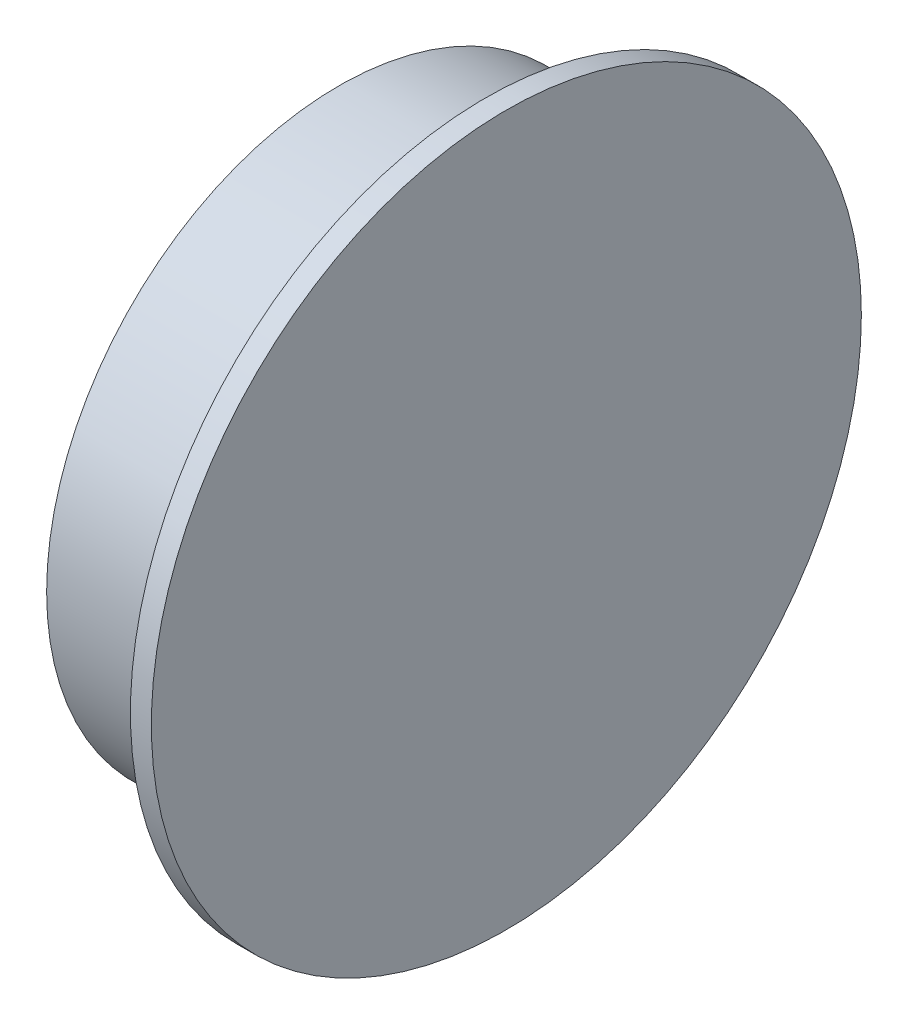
from build123d import *

# Parameters (mm, degrees)
CHANFREIN1_SIZE    = 0.5
ESQUISSE2_R        = 16.95
BOSS_EXTRU_1_DEPTH = 1
CONG_1_R           = 1.2


with BuildPart() as part:
    # Esquisse1 → R_volution1 (revolve)
    with BuildSketch(Plane.XY, mode=Mode.PRIVATE) as r_volution1_sk:
        Polygon((-5.5, 13.95), (1.5, 13.95), (1.5, 0), (0, 0), (0, 12.75), (-5.5, 12.75), align=None)
    revolve(r_volution1_sk.sketch.rotate(Axis((-7.215433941, 0, 0), (1, 0, 0)), 90), axis=Axis((-7.215433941, 0, 0), (1, 0, 0)))

    # Chanfrein1
    chanfrein1_edges = [part.edges().sort_by_distance(p)[0] for p in [
        (-5.5, 0, -12.75),
    ]]
    chamfer(chanfrein1_edges, length=CHANFREIN1_SIZE)

    # Esquisse2 → Boss.-Extru.1 (add)
    with BuildSketch(Plane(origin=(1.5, 0, 0), x_dir=(0, 0, -1), z_dir=(1, 0, 0))):
        Circle(ESQUISSE2_R)
    extrude(amount=BOSS_EXTRU_1_DEPTH)

    # Cong_1
    cong_1_edges = [part.edges().sort_by_distance(p)[0] for p in [
        (1.5, 0, -13.95),
    ]]
    fillet(cong_1_edges, radius=CONG_1_R)


solid = part.part
